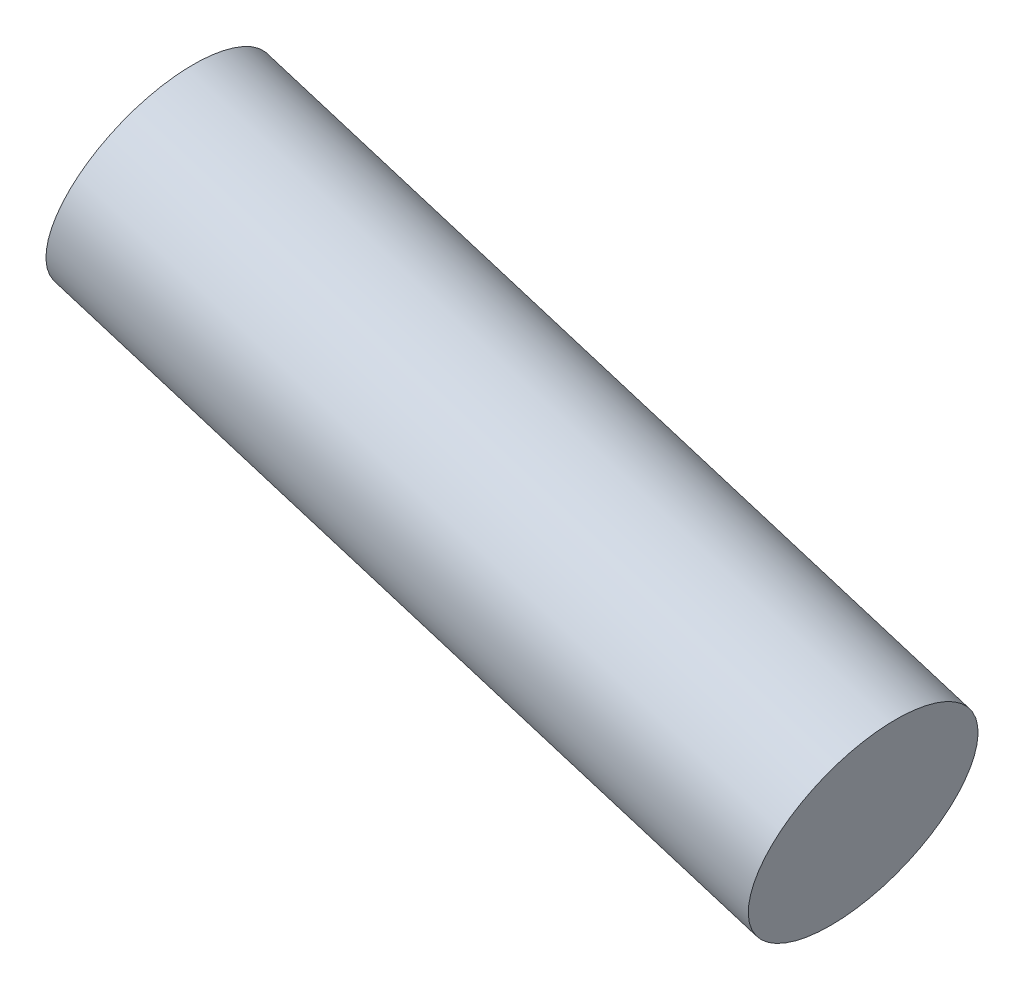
ISO-10303-21;
HEADER;
FILE_DESCRIPTION(('STEP AP214'),'2;1');
FILE_NAME('part.step','',(''),(''),'','','');
FILE_SCHEMA(('AUTOMOTIVE_DESIGN { 1 0 10303 214 1 1 1 1 }'));
ENDSEC;
DATA;
#1=APPLICATION_CONTEXT('core data for automotive mechanical design processes');
#2=APPLICATION_PROTOCOL_DEFINITION('international standard','automotive_design',2000,#1);
#3=PRODUCT_CONTEXT('',#1,'mechanical');
#4=PRODUCT('Part','Part','',(#3));
#5=PRODUCT_RELATED_PRODUCT_CATEGORY('part','',(#4));
#6=PRODUCT_DEFINITION_FORMATION('','',#4);
#7=PRODUCT_DEFINITION_CONTEXT('part definition',#1,'design');
#8=PRODUCT_DEFINITION('design','',#6,#7);
#9=PRODUCT_DEFINITION_SHAPE('','',#8);
#10=(LENGTH_UNIT() NAMED_UNIT(*) SI_UNIT(.MILLI.,.METRE.));
#11=(NAMED_UNIT(*) PLANE_ANGLE_UNIT() SI_UNIT($,.RADIAN.));
#12=(NAMED_UNIT(*) SI_UNIT($,.STERADIAN.) SOLID_ANGLE_UNIT());
#13=UNCERTAINTY_MEASURE_WITH_UNIT(LENGTH_MEASURE(1.E-05),#10,'distance_accuracy_value','');
#14=(GEOMETRIC_REPRESENTATION_CONTEXT(3) GLOBAL_UNCERTAINTY_ASSIGNED_CONTEXT((#13)) GLOBAL_UNIT_ASSIGNED_CONTEXT((#10,
#11,#12)) REPRESENTATION_CONTEXT('',''));
#15=CARTESIAN_POINT('',(0.,0.,0.));
#16=DIRECTION('',(0.,0.,1.));
#17=DIRECTION('',(1.,0.,0.));
#18=AXIS2_PLACEMENT_3D('',#15,#16,#17);
#19=CARTESIAN_POINT('',(764.608693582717,-235.315842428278,0.));
#20=DIRECTION('',(-0.955760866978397,0.294144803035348,0.));
#21=DIRECTION('',(-0.294144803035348,-0.955760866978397,0.));
#22=AXIS2_PLACEMENT_3D('',#19,#20,#21);
#23=CYLINDRICAL_SURFACE('',#22,15.0000000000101);
#24=CARTESIAN_POINT('',(764.608693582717,-235.315842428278,0.));
#25=DIRECTION('',(-0.955760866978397,0.294144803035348,0.));
#26=DIRECTION('',(-0.294144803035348,-0.955760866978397,0.));
#27=AXIS2_PLACEMENT_3D('',#24,#25,#26);
#28=CIRCLE('',#27,15.0000000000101);
#29=CARTESIAN_POINT('',(760.196521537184,-249.652255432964,0.));
#30=VERTEX_POINT('',#29);
#31=EDGE_CURVE('E37',#30,#30,#28,.T.);
#32=ORIENTED_EDGE('',*,*,#31,.F.);
#33=EDGE_LOOP('',(#32));
#34=FACE_BOUND('',#33,.T.);
#35=CARTESIAN_POINT('',(860.184780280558,-264.730322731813,0.));
#36=DIRECTION('',(-0.955760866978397,0.294144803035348,0.));
#37=DIRECTION('',(-0.294144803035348,-0.955760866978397,0.));
#38=AXIS2_PLACEMENT_3D('',#35,#36,#37);
#39=CIRCLE('',#38,15.0000000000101);
#40=CARTESIAN_POINT('',(855.772608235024,-279.066735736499,0.));
#41=VERTEX_POINT('',#40);
#42=EDGE_CURVE('E10',#41,#41,#39,.T.);
#43=ORIENTED_EDGE('',*,*,#42,.T.);
#44=EDGE_LOOP('',(#43));
#45=FACE_BOUND('',#44,.T.);
#46=ADVANCED_FACE('F31',(#34,#45),#23,.T.);
#47=CARTESIAN_POINT('',(860.184780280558,-264.730322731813,0.));
#48=DIRECTION('',(-0.955760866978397,0.294144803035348,0.));
#49=DIRECTION('',(-0.294144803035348,-0.955760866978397,0.));
#50=AXIS2_PLACEMENT_3D('',#47,#48,#49);
#51=PLANE('',#50);
#52=ORIENTED_EDGE('',*,*,#42,.F.);
#53=EDGE_LOOP('',(#52));
#54=FACE_BOUND('',#53,.T.);
#55=ADVANCED_FACE('F46',(#54),#51,.F.);
#56=CARTESIAN_POINT('',(769.020865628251,-220.979429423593,0.));
#57=DIRECTION('',(0.955760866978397,-0.294144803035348,0.));
#58=DIRECTION('',(0.294144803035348,0.955760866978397,0.));
#59=AXIS2_PLACEMENT_3D('',#56,#57,#58);
#60=PLANE('',#59);
#61=ORIENTED_EDGE('',*,*,#31,.T.);
#62=EDGE_LOOP('',(#61));
#63=FACE_BOUND('',#62,.T.);
#64=ADVANCED_FACE('F43',(#63),#60,.F.);
#65=CLOSED_SHELL('',(#46,#55,#64));
#66=MANIFOLD_SOLID_BREP('B2',#65);
#67=ADVANCED_BREP_SHAPE_REPRESENTATION('',(#18,#66),#14);
#68=SHAPE_DEFINITION_REPRESENTATION(#9,#67);
ENDSEC;
END-ISO-10303-21;
